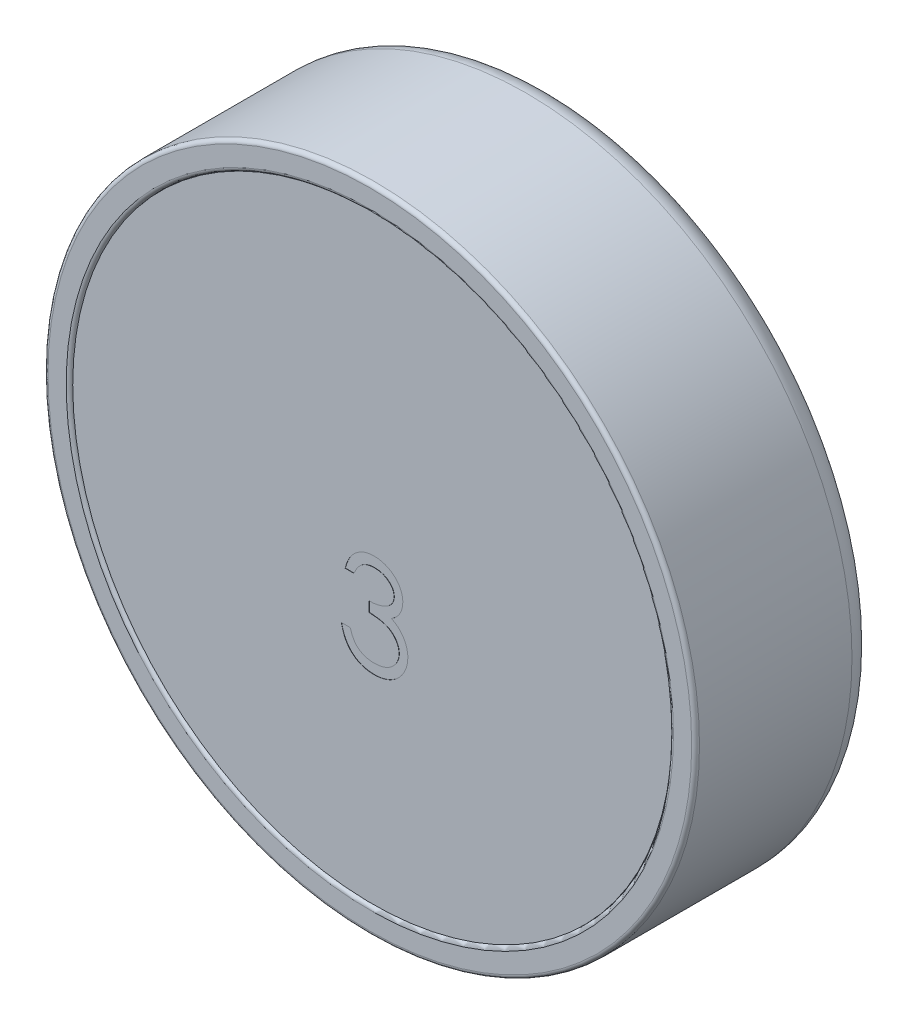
from build123d import *

# Parameters (mm, degrees)
SKETCH1_R                 = 31.75
BOSS_EXTRUDE1_DEPTH       = 17.526
SKETCH2_R                 = 29.21
CUT_EXTRUDE1_DEPTH        = 12.446
SKETCH4_R                 = 6.35
BOSS_EXTRUDE2_DEPTH       = 3.175
SKETCH5_R                 = 7.9375
BOSS_EXTRUDE3_DEPTH       = 8.255
CHAMFER1_SIZE             = 0.762
FILLET1_R                 = 0.762
FILLET2_R                 = 1.524
FILLET3_R                 = 2.286
FILLET4_R                 = 0.381
SKETCH6_R                 = 1.524
CUT_EXTRUDE3_DEPTH        = 28.575
CHAMFER2_SIZE             = 0.762
CUT_EXTRUDE4_DEPTH        = 8.255
CHAMFER3_SIZE             = 0.762
BOSS_EXTRUDE4_START       = 12.192
SKETCH17_R                = 29.21
BOSS_EXTRUDE4_DEPTH       = 12.192
BEAM_3_CUT_EXTRUDE5_DEPTH = 0.0254


with BuildPart() as part:
    # Sketch1 → Boss-Extrude1 (new body)
    with BuildSketch(Plane.XY):
        Circle(SKETCH1_R)
    extrude(amount=BOSS_EXTRUDE1_DEPTH)

    # Sketch2 → Cut-Extrude1 (cut)
    with BuildSketch(Plane.XY.offset(17.526)):
        Circle(SKETCH2_R)
    extrude(amount=-CUT_EXTRUDE1_DEPTH, mode=Mode.SUBTRACT)

    # Sketch4 → Boss-Extrude2 (add)
    with BuildSketch(Plane(origin=(0, 0, 0), x_dir=(-1, 0, 0), z_dir=(0, 0, -1))):
        with Locations(Location((0, 0, 0), (0, 0, 180))):
            Circle(SKETCH4_R)
    extrude(amount=BOSS_EXTRUDE2_DEPTH)

    # Sketch5 → Boss-Extrude3 (add)
    with BuildSketch(Plane(origin=(0, 0, -3.175), x_dir=(-1, 0, 0), z_dir=(0, 0, -1))):
        Circle(SKETCH5_R)
    extrude(amount=BOSS_EXTRUDE3_DEPTH)

    # Chamfer1
    chamfer1_edges = [part.edges().sort_by_distance(p)[0] for p in [
        (7.9375, 0, -3.175),
        (7.9375, 0, -11.43),
    ]]
    chamfer(chamfer1_edges, length=CHAMFER1_SIZE)

    # Fillet1
    fillet1_edges = [part.edges().sort_by_distance(p)[0] for p in [
        (-6.35, 0, 0),
    ]]
    fillet(fillet1_edges, radius=FILLET1_R)

    # Fillet2
    fillet2_edges = [part.edges().sort_by_distance(p)[0] for p in [
        (-29.21, 0, 5.08),
    ]]
    fillet(fillet2_edges, radius=FILLET2_R)

    # Fillet3
    fillet3_edges = [part.edges().sort_by_distance(p)[0] for p in [
        (-31.75, 0, 0),
    ]]
    fillet(fillet3_edges, radius=FILLET3_R)

    # Fillet4
    fillet4_edges = [part.edges().sort_by_distance(p)[0] for p in [
        (-31.75, 0, 17.526),
        (-29.21, 0, 17.526),
    ]]
    fillet(fillet4_edges, radius=FILLET4_R)

    # Sketch6 → Cut-Extrude3 (cut)
    with BuildSketch(Plane(origin=(0, 0, -11.43), x_dir=(-1, 0, 0), z_dir=(0, 0, -1))):
        Circle(SKETCH6_R)
    extrude(amount=-CUT_EXTRUDE3_DEPTH, mode=Mode.SUBTRACT)

    # Chamfer2
    chamfer2_edges = [part.edges().sort_by_distance(p)[0] for p in [
        (1.524, 0, 5.08),
    ]]
    chamfer(chamfer2_edges, length=CHAMFER2_SIZE)

    # Sketch7 → Cut-Extrude4 (cut)
    with BuildSketch(Plane(origin=(0, 0, -11.43), x_dir=(-1, 0, 0), z_dir=(0, 0, -1))):
        Polygon((7.513861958, 5.08), (7.513861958, 9.098726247), (-6.892148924, 9.098726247), (-6.892148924, 5.08), (0, 5.08), align=None)
        Polygon((0, -5.08), (7.415786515, -5.08), (7.415786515, -8.880792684), (-6.892148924, -8.880792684), (-6.892148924, -5.08), align=None)
    extrude(amount=-CUT_EXTRUDE4_DEPTH, mode=Mode.SUBTRACT)

    # Chamfer3
    chamfer3_edges = [part.edges().sort_by_distance(p)[0] for p in [
        (1.524, 0, -11.43),
    ]]
    chamfer(chamfer3_edges, length=CHAMFER3_SIZE)

    # 2-023 Groove Sketch → O-Ring Groove (revolve, cut)
    with BuildSketch(Plane(origin=(0, 0, 0), x_dir=(0, 0, -1), z_dir=(0, 1, 0)), mode=Mode.PRIVATE) as o_ring_groove_sk:
        with BuildLine():
            Line((-1.088937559, -13.3477), (0, -13.252430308))
            Line((0, -13.252430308), (0, -16.084569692))
            Line((0, -16.084569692), (-1.088937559, -15.9893))
            ThreePointArc((-1.088937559, -15.9893), (-1.254068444, -15.907866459), (-1.3208, -15.736266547))
            Line((-1.3208, -15.736266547), (-1.3208, -13.600733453))
            ThreePointArc((-1.3208, -13.600733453), (-1.254068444, -13.429133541), (-1.088937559, -13.3477))
        make_face()
    revolve(o_ring_groove_sk.sketch.rotate(Axis((0, 0, 0), (0, 0, 1)), 270), axis=Axis((0, 0, 0), (0, 0, 1)), mode=Mode.SUBTRACT)

    # Sketch17 → Boss-Extrude4 (add)
    with BuildSketch(Plane.XY.offset(5.08).offset(BOSS_EXTRUDE4_START)):
        with Locations(Location((0, 0, 0), (0, 0, 180))):
            Circle(SKETCH17_R)
    extrude(amount=-BOSS_EXTRUDE4_DEPTH)

    # Sketch21 → Beam 3 Cut-Extrude5 (cut)
    with BuildSketch(Plane.XY.offset(17.272)):
        with BuildLine():
            Line((-1.801201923, -2.198076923), (-2.656009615, -2.198076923))
            add(Edge.make_bspline(
                [(-2.656009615, -2.198076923), (-2.632851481, -2.102194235), (-2.587579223, -1.914751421), (-2.493152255, -1.64694309), (-2.390284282, -1.393514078), (-2.266761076, -1.159209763), (-2.132026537, -0.939321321), (-1.977659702, -0.73883606), (-1.810782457, -0.552655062), (-1.626201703, -0.387428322), (-1.43263013, -0.237810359), (-1.227340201, -0.110243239), (-1.014462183, -0.000503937), (-0.792521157, 0.089902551), (-0.560856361, 0.158007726), (-0.321562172, 0.207420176), (-0.074011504, 0.239508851), (0.094030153, 0.24264057), (0.179356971, 0.244230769)],
                knots=[0, 0, 0, 0, 1.162005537, 2.271625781, 3.343758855, 4.383309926, 5.390229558, 6.379919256, 7.361854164, 8.333198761, 9.295911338, 10.242430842, 11.177959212, 12.116337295, 13.062827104, 14.020064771, 14.994644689, 16, 16, 16, 16], degree=3))
            add(Edge.make_bspline(
                [(0.179356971, 0.244230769), (0.303679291, 0.240477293), (0.549612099, 0.233052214), (0.910917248, 0.165249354), (1.259333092, 0.057956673), (1.591045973, -0.090289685), (1.89916185, -0.273135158), (2.173308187, -0.490753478), (2.409769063, -0.738945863), (2.608145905, -1.013082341), (2.763471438, -1.306059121), (2.878006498, -1.607593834), (2.947734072, -1.916971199), (2.95677073, -2.125860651), (2.961298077, -2.230513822)],
                knots=[0, 0, 0, 0, 1.083050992, 2.142477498, 3.193116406, 4.255571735, 5.30263384, 6.308962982, 7.297363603, 8.282367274, 9.249857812, 10.179914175, 11.08814088, 12, 12, 12, 12], degree=3))
            add(Edge.make_bspline(
                [(2.961298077, -2.230513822), (2.958131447, -2.331225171), (2.951934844, -2.528301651), (2.899319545, -2.816015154), (2.81077443, -3.087182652), (2.68812029, -3.342945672), (2.529347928, -3.581682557), (2.337017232, -3.803930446), (2.109770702, -4.010675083), (1.937561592, -4.12911022), (1.848903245, -4.190084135)],
                knots=[0, 0, 0, 0, 1.024540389, 2.004866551, 2.965041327, 3.920577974, 4.882998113, 5.874504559, 6.905732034, 8, 8, 8, 8], degree=3))
            add(Edge.make_bspline(
                [(1.848903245, -4.190084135), (1.950226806, -4.239010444), (2.150978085, -4.335947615), (2.424619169, -4.526055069), (2.673025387, -4.745555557), (2.811556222, -4.916849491), (2.881159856, -5.002914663)],
                knots=[0, 0, 0, 0, 1.015518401, 2.012035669, 3.001164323, 4, 4, 4, 4], degree=3))
            add(Edge.make_bspline(
                [(2.881159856, -5.002914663), (2.926992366, -5.065664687), (3.017906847, -5.19013716), (3.130126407, -5.390261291), (3.23193264, -5.592603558), (3.311262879, -5.80258737), (3.372696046, -6.017778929), (3.416609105, -6.238547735), (3.443889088, -6.465074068), (3.44779584, -6.61832446), (3.449759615, -6.695357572)],
                knots=[0, 0, 0, 0, 1.025084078, 2.033381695, 3.024893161, 4.013698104, 4.991890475, 5.976764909, 6.982997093, 8, 8, 8, 8], degree=3))
            add(Edge.make_bspline(
                [(3.449759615, -6.695357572), (3.444875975, -6.828734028), (3.435131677, -7.094859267), (3.348034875, -7.488036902), (3.213015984, -7.872372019), (3.021272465, -8.239968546), (2.787590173, -8.583903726), (2.509576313, -8.891632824), (2.19038973, -9.156151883), (1.8344115, -9.377159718), (1.448738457, -9.553829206), (1.03623631, -9.676449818), (0.602848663, -9.75631286), (0.305648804, -9.764876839), (0.154552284, -9.769230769)],
                knots=[0, 0, 0, 0, 0.955779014, 1.907060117, 2.875433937, 3.871313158, 4.872415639, 5.851225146, 6.836215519, 7.83643374, 8.849228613, 9.86973379, 10.916971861, 12, 12, 12, 12], degree=3))
            add(Edge.make_bspline(
                [(0.154552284, -9.769230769), (0.052718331, -9.766867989), (-0.147656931, -9.762218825), (-0.44223388, -9.730436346), (-0.723416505, -9.67238826), (-0.991584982, -9.594274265), (-1.246977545, -9.495236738), (-1.48881486, -9.371905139), (-1.718584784, -9.226821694), (-1.934119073, -9.058273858), (-2.135392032, -8.869729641), (-2.317054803, -8.657841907), (-2.482136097, -8.426527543), (-2.626215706, -8.173099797), (-2.75585627, -7.900833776), (-2.862484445, -7.60624322), (-2.956334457, -7.291961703), (-2.999968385, -7.072947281), (-3.022355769, -6.960576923)],
                knots=[0, 0, 0, 0, 1.048658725, 2.063410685, 3.046034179, 4.001477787, 4.936774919, 5.862367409, 6.792675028, 7.730719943, 8.675894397, 9.627829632, 10.600096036, 11.597688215, 12.626045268, 13.701542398, 14.82072376, 16, 16, 16, 16], degree=3))
            Line((-3.022355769, -6.960576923), (-2.167548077, -6.960576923))
            add(Edge.make_bspline(
                [(-2.167548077, -6.960576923), (-2.145277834, -7.033916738), (-2.101960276, -7.176569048), (-2.02822508, -7.381874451), (-1.944219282, -7.570083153), (-1.854100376, -7.742575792), (-1.759453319, -7.901051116), (-1.65354913, -8.041318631), (-1.544231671, -8.169539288), (-1.461828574, -8.241778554), (-1.421499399, -8.277133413)],
                knots=[0, 0, 0, 0, 1.198163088, 2.33053128, 3.407730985, 4.417276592, 5.372219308, 6.28897303, 7.162600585, 8, 8, 8, 8], degree=3))
            add(Edge.make_bspline(
                [(-1.421499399, -8.277133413), (-1.368168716, -8.318249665), (-1.261671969, -8.400355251), (-1.088131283, -8.505134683), (-0.905618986, -8.595924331), (-0.710180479, -8.665276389), (-0.50603314, -8.723998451), (-0.289877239, -8.762426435), (-0.063619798, -8.788792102), (0.090869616, -8.791118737), (0.169816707, -8.792307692)],
                knots=[0, 0, 0, 0, 0.946170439, 1.889420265, 2.845303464, 3.807233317, 4.801018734, 5.828864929, 6.890507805, 8, 8, 8, 8], degree=3))
            add(Edge.make_bspline(
                [(0.169816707, -8.792307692), (0.258953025, -8.79063155), (0.433251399, -8.787353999), (0.687582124, -8.757212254), (0.929537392, -8.713314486), (1.156430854, -8.645515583), (1.371234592, -8.561747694), (1.57093751, -8.456568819), (1.758161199, -8.333166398), (1.930507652, -8.192906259), (2.085480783, -8.039359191), (2.221931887, -7.878759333), (2.337931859, -7.711783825), (2.431504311, -7.537508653), (2.505392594, -7.356655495), (2.555693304, -7.168716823), (2.590667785, -6.975230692), (2.593516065, -6.843706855), (2.594951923, -6.777403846)],
                knots=[0, 0, 0, 0, 1.217147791, 2.380027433, 3.494444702, 4.572153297, 5.609568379, 6.639424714, 7.649109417, 8.668170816, 9.669597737, 10.625200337, 11.543417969, 12.441394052, 13.322311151, 14.205496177, 15.095365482, 16, 16, 16, 16], degree=3))
            add(Edge.make_bspline(
                [(2.594951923, -6.777403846), (2.590787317, -6.688654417), (2.582478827, -6.511597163), (2.519046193, -6.251108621), (2.414709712, -6.000129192), (2.268643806, -5.762940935), (2.090837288, -5.543115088), (1.883015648, -5.346977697), (1.643453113, -5.185134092), (1.422963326, -5.073314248), (1.227659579, -4.997013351), (1.060521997, -4.946190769), (0.873405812, -4.903155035), (0.66857382, -4.863116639), (0.444482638, -4.829040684), (0.201376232, -4.800624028), (-0.060794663, -4.777886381), (-0.242289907, -4.767732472), (-0.335817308, -4.7625)],
                knots=[0, 0, 0, 0, 1.07054697, 2.135767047, 3.216561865, 4.33974944, 5.486079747, 6.621378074, 7.775625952, 8.963672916, 9.598146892, 10.304877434, 11.070270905, 11.915000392, 12.823868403, 13.805723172, 14.86925407, 16, 16, 16, 16], degree=3))
            Line((-0.335817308, -4.7625), (-0.335817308, -3.785576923))
            add(Edge.make_bspline(
                [(-0.335817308, -3.785576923), (-0.217976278, -3.783577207), (0.012845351, -3.779660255), (0.350014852, -3.732285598), (0.672431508, -3.666751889), (0.972949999, -3.566371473), (1.246858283, -3.449784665), (1.484492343, -3.314115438), (1.682522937, -3.163308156), (1.83998771, -2.995035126), (1.958449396, -2.814563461), (2.045063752, -2.626467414), (2.096227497, -2.429098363), (2.103057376, -2.294402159), (2.106490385, -2.226697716)],
                knots=[0, 0, 0, 0, 1.321986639, 2.589447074, 3.816329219, 5.01088745, 6.139805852, 7.153945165, 8.075214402, 8.924034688, 9.728124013, 10.488707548, 11.240355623, 12, 12, 12, 12], degree=3))
            add(Edge.make_bspline(
                [(2.106490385, -2.226697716), (2.105362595, -2.176956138), (2.10311891, -2.077997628), (2.074823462, -1.933421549), (2.03230375, -1.793265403), (1.973848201, -1.658125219), (1.895606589, -1.52893826), (1.801973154, -1.404603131), (1.690481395, -1.285829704), (1.562722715, -1.17512112), (1.425530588, -1.06961341), (1.275172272, -0.980041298), (1.116181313, -0.903446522), (0.948381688, -0.84028352), (0.771228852, -0.792769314), (0.585555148, -0.758653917), (0.391006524, -0.737324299), (0.258277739, -0.734253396), (0.190805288, -0.732692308)],
                knots=[0, 0, 0, 0, 0.884392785, 1.759457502, 2.611959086, 3.489218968, 4.37281399, 5.2945488, 6.255912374, 7.266815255, 8.301784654, 9.332968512, 10.37626691, 11.440494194, 12.520033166, 13.637162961, 14.798855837, 16, 16, 16, 16], degree=3))
            add(Edge.make_bspline(
                [(0.190805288, -0.732692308), (0.082351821, -0.7364788), (-0.129483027, -0.7438747), (-0.434867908, -0.808652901), (-0.718765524, -0.912007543), (-0.935768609, -1.035378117), (-1.096013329, -1.157163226), (-1.210522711, -1.263523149), (-1.322973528, -1.381722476), (-1.425967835, -1.51904134), (-1.530127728, -1.666180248), (-1.624954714, -1.830618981), (-1.717101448, -2.008068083), (-1.772625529, -2.13351406), (-1.801201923, -2.198076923)],
                knots=[0, 0, 0, 0, 1.472543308, 2.876219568, 4.221790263, 5.565193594, 6.249813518, 6.953379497, 7.687249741, 8.463570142, 9.283606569, 10.136032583, 11.040678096, 12, 12, 12, 12], degree=3))
        make_face()
    extrude(amount=-BEAM_3_CUT_EXTRUDE5_DEPTH, mode=Mode.SUBTRACT)


solid = part.part
